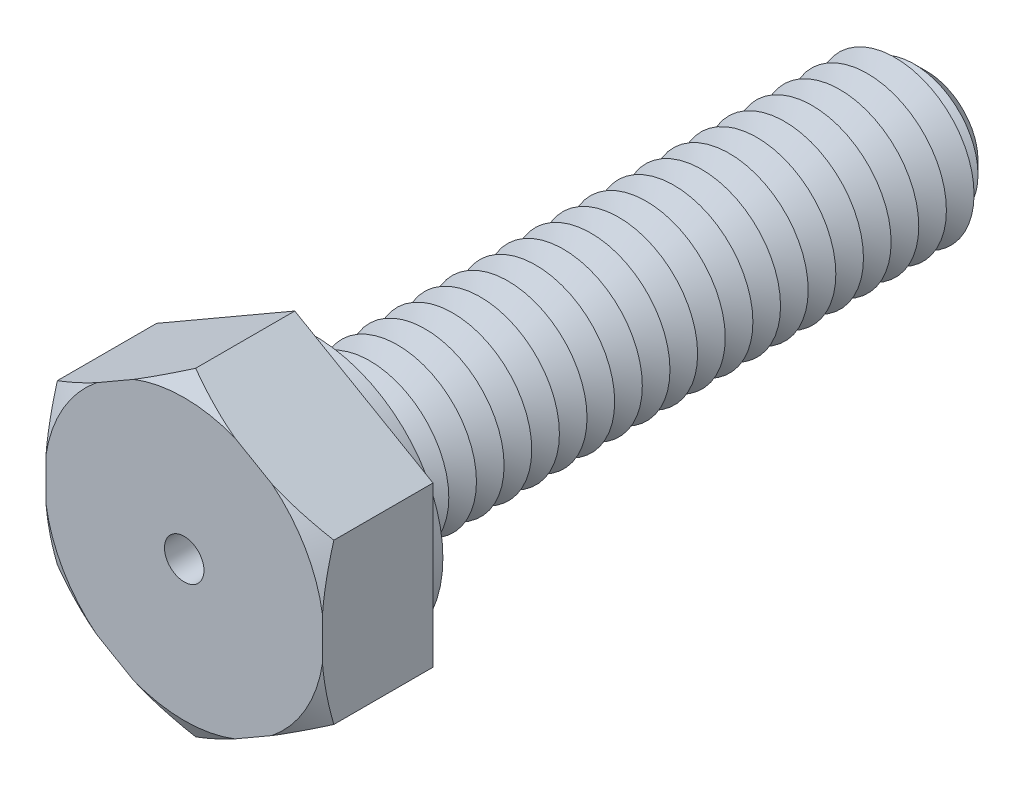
from build123d import *

# Parameters (mm, degrees)
BOSS_EXTRUDE1_DEPTH = 2.8
SKETCH3_R           = 2
BOSS_EXTRUDE2_DEPTH = 16
SKETCH4_R           = 3.25
BOSS_EXTRUDE3_DEPTH = 0.5
CHAMFER1_SIZE       = 0.7
LPATTERN1_COUNT     = 22
LPATTERN1_PITCH     = 0.7
SKETCH8_R           = 0.5
CUT_EXTRUDE1_DEPTH  = 18.8


with BuildPart() as part:
    # Sketch2 → Boss-Extrude1 (new body)
    with BuildSketch(Plane.XY):
        Polygon((0, 4.041451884), (-3.5, 2.020725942), (-3.5, -2.020725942), (0, -4.041451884), (3.5, -2.020725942), (3.5, 2.020725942), align=None)
    extrude(amount=BOSS_EXTRUDE1_DEPTH)

    # Sketch3 → Boss-Extrude2 (add)
    with BuildSketch(Plane(origin=(0, 0, 0), x_dir=(-1, 0, 0), z_dir=(0, 0, -1))):
        Circle(SKETCH3_R)
    extrude(amount=BOSS_EXTRUDE2_DEPTH)

    # Sketch4 → Boss-Extrude3 (add)
    with BuildSketch(Plane(origin=(0, 0, 0), x_dir=(-1, 0, 0), z_dir=(0, 0, -1))):
        with Locations(Location((0, 0, 0), (0, 0, 180))):
            Circle(SKETCH4_R)
    extrude(amount=BOSS_EXTRUDE3_DEPTH)

    # Chamfer1
    chamfer1_edges = [part.edges().sort_by_distance(p)[0] for p in [
        (2, 0, -16),
    ]]
    chamfer(chamfer1_edges, length=CHAMFER1_SIZE)

    # Sketch6 → Cut-Revolve1 (revolve, cut)
    with BuildSketch(Plane(origin=(0, 0, 0), x_dir=(0, 0, -1), z_dir=(1, 0, 0)), mode=Mode.PRIVATE) as cut_revolve1_sk:
        Polygon((0.5, 2), (0.85, 1.393782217), (1.2, 2), align=None)
    cut_revolve1 = revolve(cut_revolve1_sk.sketch.rotate(Axis((0, 0, 3.211670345), (0, 0, -1)), 90), axis=Axis((0, 0, 3.211670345), (0, 0, -1)), mode=Mode.SUBTRACT)

    # LPattern1: Cut-Revolve1 ×22
    with Locations(*[(0, 0, -i * LPATTERN1_PITCH) for i in range(1, LPATTERN1_COUNT)]):
        add(cut_revolve1, mode=Mode.SUBTRACT)

    # Sketch7 → Cut-Revolve2 (revolve, cut)
    with BuildSketch(Plane(origin=(0, 0, 0), x_dir=(0, 0, -1), z_dir=(1, 0, 0)), mode=Mode.PRIVATE) as cut_revolve2_sk:
        Polygon((-2.8, 4.041451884), (-2.8, 3.541451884), (-2.511324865, 4.041451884), align=None)
    revolve(cut_revolve2_sk.sketch.rotate(Axis((0, 0, 3.211670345), (0, 0, -1)), 90), axis=Axis((0, 0, 3.211670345), (0, 0, -1)), mode=Mode.SUBTRACT)

    # Sketch8 → Cut-Extrude1 (cut)
    with BuildSketch(Plane.XY.offset(2.8)):
        Circle(SKETCH8_R)
    extrude(amount=-CUT_EXTRUDE1_DEPTH, mode=Mode.SUBTRACT)


solid = part.part
